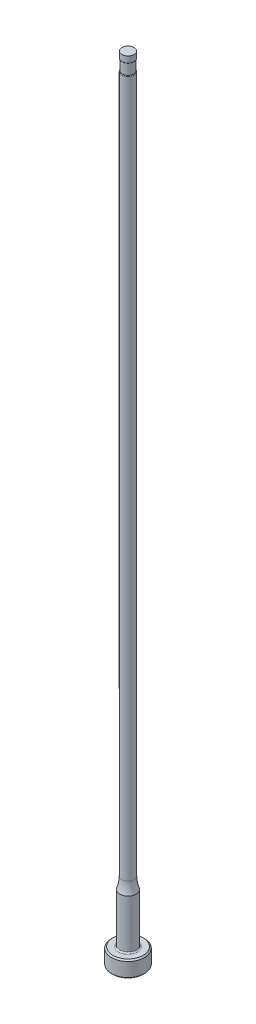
ISO-10303-21;
HEADER;
FILE_DESCRIPTION(('STEP AP214'),'2;1');
FILE_NAME('part.step','',(''),(''),'','','');
FILE_SCHEMA(('AUTOMOTIVE_DESIGN { 1 0 10303 214 1 1 1 1 }'));
ENDSEC;
DATA;
#1=APPLICATION_CONTEXT('core data for automotive mechanical design processes');
#2=APPLICATION_PROTOCOL_DEFINITION('international standard','automotive_design',2000,#1);
#3=PRODUCT_CONTEXT('',#1,'mechanical');
#4=PRODUCT('Part','Part','',(#3));
#5=PRODUCT_RELATED_PRODUCT_CATEGORY('part','',(#4));
#6=PRODUCT_DEFINITION_FORMATION('','',#4);
#7=PRODUCT_DEFINITION_CONTEXT('part definition',#1,'design');
#8=PRODUCT_DEFINITION('design','',#6,#7);
#9=PRODUCT_DEFINITION_SHAPE('','',#8);
#10=(LENGTH_UNIT() NAMED_UNIT(*) SI_UNIT(.MILLI.,.METRE.));
#11=(NAMED_UNIT(*) PLANE_ANGLE_UNIT() SI_UNIT($,.RADIAN.));
#12=(NAMED_UNIT(*) SI_UNIT($,.STERADIAN.) SOLID_ANGLE_UNIT());
#13=UNCERTAINTY_MEASURE_WITH_UNIT(LENGTH_MEASURE(1.E-05),#10,'distance_accuracy_value','');
#14=(GEOMETRIC_REPRESENTATION_CONTEXT(3) GLOBAL_UNCERTAINTY_ASSIGNED_CONTEXT((#13)) GLOBAL_UNIT_ASSIGNED_CONTEXT((#10,
#11,#12)) REPRESENTATION_CONTEXT('',''));
#15=CARTESIAN_POINT('',(0.,0.,0.));
#16=DIRECTION('',(0.,0.,1.));
#17=DIRECTION('',(1.,0.,0.));
#18=AXIS2_PLACEMENT_3D('',#15,#16,#17);
#19=CARTESIAN_POINT('',(0.,259.958771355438,0.));
#20=DIRECTION('',(0.,1.,0.));
#21=DIRECTION('',(0.,0.,1.));
#22=AXIS2_PLACEMENT_3D('',#19,#20,#21);
#23=CYLINDRICAL_SURFACE('',#22,1.18998999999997);
#24=DIRECTION('',(0.,1.,0.));
#25=VECTOR('',#24,1.);
#26=CARTESIAN_POINT('',(-1.08838999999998,259.958771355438,-0.481127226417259));
#27=LINE('',#26,#25);
#28=CARTESIAN_POINT('',(-1.08838999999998,148.973565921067,-0.481127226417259));
#29=VERTEX_POINT('',#28);
#30=CARTESIAN_POINT('',(-1.08838999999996,112.014,-0.481127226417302));
#31=VERTEX_POINT('',#30);
#32=EDGE_CURVE('E66',#29,#31,#27,.F.);
#33=ORIENTED_EDGE('',*,*,#32,.F.);
#34=CARTESIAN_POINT('',(0.,148.973565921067,0.));
#35=DIRECTION('',(0.,1.,0.));
#36=DIRECTION('',(0.,0.,1.));
#37=AXIS2_PLACEMENT_3D('',#34,#35,#36);
#38=CIRCLE('',#37,1.18998999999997);
#39=CARTESIAN_POINT('',(-1.08838999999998,148.973565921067,0.481127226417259));
#40=VERTEX_POINT('',#39);
#41=EDGE_CURVE('E44',#29,#40,#38,.F.);
#42=ORIENTED_EDGE('',*,*,#41,.T.);
#43=DIRECTION('',(0.,1.,0.));
#44=VECTOR('',#43,1.);
#45=CARTESIAN_POINT('',(-1.08838999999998,259.958771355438,0.481127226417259));
#46=LINE('',#45,#44);
#47=CARTESIAN_POINT('',(-1.08838999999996,112.014,0.481127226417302));
#48=VERTEX_POINT('',#47);
#49=EDGE_CURVE('E72',#48,#40,#46,.T.);
#50=ORIENTED_EDGE('',*,*,#49,.F.);
#51=CARTESIAN_POINT('',(-1.08838999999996,112.014,-0.481127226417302));
#52=CARTESIAN_POINT('',(-1.08838966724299,111.985183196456,-0.481120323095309));
#53=CARTESIAN_POINT('',(-1.08878297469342,111.956379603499,-0.480240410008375));
#54=CARTESIAN_POINT('',(-1.0903471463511,111.89887486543,-0.476680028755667));
#55=CARTESIAN_POINT('',(-1.09151883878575,111.870173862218,-0.473997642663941));
#56=CARTESIAN_POINT('',(-1.0962236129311,111.783732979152,-0.463079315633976));
#57=CARTESIAN_POINT('',(-1.10094613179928,111.726365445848,-0.451969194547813));
#58=CARTESIAN_POINT('',(-1.11171709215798,111.627397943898,-0.424640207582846));
#59=CARTESIAN_POINT('',(-1.11720060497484,111.585237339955,-0.41021369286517));
#60=CARTESIAN_POINT('',(-1.12939077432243,111.50375729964,-0.375363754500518));
#61=CARTESIAN_POINT('',(-1.13609165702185,111.46442562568,-0.354968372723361));
#62=CARTESIAN_POINT('',(-1.1472645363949,111.404969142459,-0.316366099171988));
#63=CARTESIAN_POINT('',(-1.15158336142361,111.383348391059,-0.300422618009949));
#64=CARTESIAN_POINT('',(-1.16012072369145,111.342602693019,-0.265553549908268));
#65=CARTESIAN_POINT('',(-1.16433935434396,111.323475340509,-0.246630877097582));
#66=CARTESIAN_POINT('',(-1.17139417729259,111.292625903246,-0.210179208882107));
#67=CARTESIAN_POINT('',(-1.17432972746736,111.280201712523,-0.193268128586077));
#68=CARTESIAN_POINT('',(-1.17964378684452,111.258180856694,-0.157607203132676));
#69=CARTESIAN_POINT('',(-1.18202305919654,111.248580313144,-0.138859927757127));
#70=CARTESIAN_POINT('',(-1.1856222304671,111.234246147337,-0.103155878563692));
#71=CARTESIAN_POINT('',(-1.1869702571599,111.228963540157,-0.0864338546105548));
#72=CARTESIAN_POINT('',(-1.18896221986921,111.221197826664,-0.05230931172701));
#73=CARTESIAN_POINT('',(-1.18960661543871,111.218712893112,-0.0349072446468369));
#74=CARTESIAN_POINT('',(-1.1901191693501,111.216734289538,0.000122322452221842));
#75=CARTESIAN_POINT('',(-1.18998545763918,111.217247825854,0.0177502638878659));
#76=CARTESIAN_POINT('',(-1.18895328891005,111.221240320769,0.0526432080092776));
#77=CARTESIAN_POINT('',(-1.18805460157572,111.224720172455,0.0699080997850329));
#78=CARTESIAN_POINT('',(-1.18562828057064,111.23423683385,0.103108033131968));
#79=CARTESIAN_POINT('',(-1.18411982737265,111.240195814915,0.11906720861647));
#80=CARTESIAN_POINT('',(-1.18061056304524,111.254296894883,0.149921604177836));
#81=CARTESIAN_POINT('',(-1.17860955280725,111.262439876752,0.164816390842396));
#82=CARTESIAN_POINT('',(-1.17313921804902,111.285184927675,0.200749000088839));
#83=CARTESIAN_POINT('',(-1.1694436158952,111.300956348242,0.221012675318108));
#84=CARTESIAN_POINT('',(-1.16168543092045,111.335494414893,0.258718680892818));
#85=CARTESIAN_POINT('',(-1.15762196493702,111.354268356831,0.276153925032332));
#86=CARTESIAN_POINT('',(-1.14734460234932,111.404227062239,0.316729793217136));
#87=CARTESIAN_POINT('',(-1.14110751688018,111.436801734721,0.338145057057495));
#88=CARTESIAN_POINT('',(-1.12927494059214,111.504924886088,0.375765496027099));
#89=CARTESIAN_POINT('',(-1.12368108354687,111.54048055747,0.391957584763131));
#90=CARTESIAN_POINT('',(-1.11078204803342,111.633330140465,0.427525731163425));
#91=CARTESIAN_POINT('',(-1.10420802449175,111.691901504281,0.443819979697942));
#92=CARTESIAN_POINT('',(-1.09432365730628,111.810957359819,0.467642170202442));
#93=CARTESIAN_POINT('',(-1.09101219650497,111.871441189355,0.475173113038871));
#94=CARTESIAN_POINT('',(-1.0890934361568,111.945778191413,0.479532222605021));
#95=CARTESIAN_POINT('',(-1.08882945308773,111.959431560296,0.480131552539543));
#96=CARTESIAN_POINT('',(-1.08847803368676,111.986722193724,0.480928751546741));
#97=CARTESIAN_POINT('',(-1.08839020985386,112.000359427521,0.481127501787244));
#98=CARTESIAN_POINT('',(-1.08838999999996,112.014,0.481127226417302));
#99=B_SPLINE_CURVE_WITH_KNOTS('',3,(#51,#52,#53,#54,#55,#56,#57,#58,#59,#60,#61,#62,#63,#64,#65,
#66,#67,#68,#69,#70,#71,#72,#73,#74,#75,#76,#77,#78,#79,#80,#81,#82,#83,#84,#85,#86,#87,#88,#89,
#90,#91,#92,#93,#94,#95,#96,#97,#98),.UNSPECIFIED.,.F.,.F.,(4,2,2,2,2,2,2,2,2,2,2,2,2,2,2,2,2,2,
2,2,2,2,2,4),(0.,0.0864065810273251,0.172905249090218,0.348016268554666,0.48234589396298,
0.616054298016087,0.697472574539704,0.778811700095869,0.842154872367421,0.905410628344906,
0.95794971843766,1.01045447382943,1.0630854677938,1.11573231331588,1.16683808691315,
1.21796455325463,1.29535063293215,1.37292769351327,1.49070506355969,1.60877526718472,
1.79125586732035,1.9736739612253,2.01467753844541,2.05559081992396),.UNSPECIFIED.);
#100=EDGE_CURVE('E74',#31,#48,#99,.T.);
#101=ORIENTED_EDGE('',*,*,#100,.F.);
#102=EDGE_LOOP('',(#33,#42,#50,#101));
#103=FACE_BOUND('',#102,.T.);
#104=CARTESIAN_POINT('',(0.,14.9114164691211,0.));
#105=DIRECTION('',(0.,1.,0.));
#106=DIRECTION('',(0.,0.,1.));
#107=AXIS2_PLACEMENT_3D('',#104,#105,#106);
#108=CIRCLE('',#107,1.18998999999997);
#109=CARTESIAN_POINT('',(0.,14.9114164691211,1.18998999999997));
#110=VERTEX_POINT('',#109);
#111=EDGE_CURVE('E95',#110,#110,#108,.T.);
#112=ORIENTED_EDGE('',*,*,#111,.T.);
#113=EDGE_LOOP('',(#112));
#114=FACE_BOUND('',#113,.T.);
#115=ADVANCED_FACE('F36',(#103,#114),#23,.T.);
#116=CARTESIAN_POINT('',(0.,14.9114164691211,0.));
#117=DIRECTION('',(0.,1.,0.));
#118=DIRECTION('',(0.,0.,1.));
#119=AXIS2_PLACEMENT_3D('',#116,#117,#118);
#120=TOROIDAL_SURFACE('',#119,7.53998999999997,6.35);
#121=CARTESIAN_POINT('',(0.,12.7,0.));
#122=DIRECTION('',(0.,1.,0.));
#123=DIRECTION('',(0.,0.,1.));
#124=AXIS2_PLACEMENT_3D('',#121,#122,#123);
#125=CIRCLE('',#124,1.58749999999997);
#126=CARTESIAN_POINT('',(0.,12.7,1.58749999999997));
#127=VERTEX_POINT('',#126);
#128=EDGE_CURVE('E92',#127,#127,#125,.T.);
#129=ORIENTED_EDGE('',*,*,#128,.T.);
#130=EDGE_LOOP('',(#129));
#131=FACE_BOUND('',#130,.T.);
#132=ORIENTED_EDGE('',*,*,#111,.F.);
#133=EDGE_LOOP('',(#132));
#134=FACE_BOUND('',#133,.T.);
#135=ADVANCED_FACE('F156',(#131,#134),#120,.F.);
#136=CARTESIAN_POINT('',(0.,259.958771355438,0.));
#137=DIRECTION('',(0.,1.,0.));
#138=DIRECTION('',(0.,0.,1.));
#139=AXIS2_PLACEMENT_3D('',#136,#137,#138);
#140=CYLINDRICAL_SURFACE('',#139,1.58749999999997);
#141=CARTESIAN_POINT('',(0.,3.42900000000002,0.));
#142=DIRECTION('',(0.,1.,0.));
#143=DIRECTION('',(0.,0.,1.));
#144=AXIS2_PLACEMENT_3D('',#141,#142,#143);
#145=CIRCLE('',#144,1.58749999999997);
#146=CARTESIAN_POINT('',(0.,3.42900000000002,1.58749999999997));
#147=VERTEX_POINT('',#146);
#148=EDGE_CURVE('E110',#147,#147,#145,.T.);
#149=ORIENTED_EDGE('',*,*,#148,.T.);
#150=EDGE_LOOP('',(#149));
#151=FACE_BOUND('',#150,.T.);
#152=ORIENTED_EDGE('',*,*,#128,.F.);
#153=EDGE_LOOP('',(#152));
#154=FACE_BOUND('',#153,.T.);
#155=ADVANCED_FACE('F153',(#151,#154),#140,.T.);
#156=CARTESIAN_POINT('',(-3.17499999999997,3.175,0.));
#157=DIRECTION('',(0.,1.,0.));
#158=DIRECTION('',(0.,0.,1.));
#159=AXIS2_PLACEMENT_3D('',#156,#157,#158);
#160=PLANE('',#159);
#161=CARTESIAN_POINT('',(0.,3.175,0.));
#162=DIRECTION('',(0.,1.,0.));
#163=DIRECTION('',(0.,0.,1.));
#164=AXIS2_PLACEMENT_3D('',#161,#162,#163);
#165=CIRCLE('',#164,1.84149999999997);
#166=CARTESIAN_POINT('',(0.,3.175,1.84149999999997));
#167=VERTEX_POINT('',#166);
#168=EDGE_CURVE('E78',#167,#167,#165,.F.);
#169=ORIENTED_EDGE('',*,*,#168,.T.);
#170=EDGE_LOOP('',(#169));
#171=FACE_BOUND('',#170,.T.);
#172=CARTESIAN_POINT('',(0.,3.175,0.));
#173=DIRECTION('',(0.,1.,0.));
#174=DIRECTION('',(0.,0.,1.));
#175=AXIS2_PLACEMENT_3D('',#172,#173,#174);
#176=CIRCLE('',#175,2.92099999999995);
#177=CARTESIAN_POINT('',(0.,3.175,2.92099999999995));
#178=VERTEX_POINT('',#177);
#179=EDGE_CURVE('E98',#178,#178,#176,.T.);
#180=ORIENTED_EDGE('',*,*,#179,.T.);
#181=EDGE_LOOP('',(#180));
#182=FACE_BOUND('',#181,.T.);
#183=ADVANCED_FACE('F149',(#171,#182),#160,.T.);
#184=CARTESIAN_POINT('',(0.,259.958771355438,0.));
#185=DIRECTION('',(0.,1.,0.));
#186=DIRECTION('',(0.,0.,1.));
#187=AXIS2_PLACEMENT_3D('',#184,#185,#186);
#188=CYLINDRICAL_SURFACE('',#187,3.17499999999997);
#189=CARTESIAN_POINT('',(0.,2.92100000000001,0.));
#190=DIRECTION('',(0.,1.,0.));
#191=DIRECTION('',(0.,0.,1.));
#192=AXIS2_PLACEMENT_3D('',#189,#190,#191);
#193=CIRCLE('',#192,3.17499999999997);
#194=CARTESIAN_POINT('',(0.,2.92100000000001,3.17499999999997));
#195=VERTEX_POINT('',#194);
#196=EDGE_CURVE('E104',#195,#195,#193,.F.);
#197=ORIENTED_EDGE('',*,*,#196,.T.);
#198=EDGE_LOOP('',(#197));
#199=FACE_BOUND('',#198,.T.);
#200=CARTESIAN_POINT('',(0.,0.254000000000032,0.));
#201=DIRECTION('',(0.,-1.,0.));
#202=DIRECTION('',(0.,0.,-1.));
#203=AXIS2_PLACEMENT_3D('',#200,#201,#202);
#204=CIRCLE('',#203,3.17499999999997);
#205=CARTESIAN_POINT('',(0.,0.254000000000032,-3.17499999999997));
#206=VERTEX_POINT('',#205);
#207=EDGE_CURVE('E101',#206,#206,#204,.F.);
#208=ORIENTED_EDGE('',*,*,#207,.T.);
#209=EDGE_LOOP('',(#208));
#210=FACE_BOUND('',#209,.T.);
#211=ADVANCED_FACE('F145',(#199,#210),#188,.T.);
#212=CARTESIAN_POINT('',(0.,0.,0.));
#213=DIRECTION('',(0.,-1.,0.));
#214=DIRECTION('',(0.,0.,-1.));
#215=AXIS2_PLACEMENT_3D('',#212,#213,#214);
#216=PLANE('',#215);
#217=CARTESIAN_POINT('',(0.,0.,0.));
#218=DIRECTION('',(0.,-1.,0.));
#219=DIRECTION('',(0.,0.,-1.));
#220=AXIS2_PLACEMENT_3D('',#217,#218,#219);
#221=CIRCLE('',#220,2.92099999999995);
#222=CARTESIAN_POINT('',(0.,0.,-2.92099999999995));
#223=VERTEX_POINT('',#222);
#224=EDGE_CURVE('E107',#223,#223,#221,.T.);
#225=ORIENTED_EDGE('',*,*,#224,.T.);
#226=EDGE_LOOP('',(#225));
#227=FACE_BOUND('',#226,.T.);
#228=ADVANCED_FACE('F141',(#227),#216,.T.);
#229=CARTESIAN_POINT('',(0.,3.17499999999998,0.));
#230=DIRECTION('',(0.,-1.,0.));
#231=DIRECTION('',(0.,0.,-1.));
#232=AXIS2_PLACEMENT_3D('',#229,#230,#231);
#233=CONICAL_SURFACE('',#232,2.92099999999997,0.7853981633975);
#234=ORIENTED_EDGE('',*,*,#196,.F.);
#235=EDGE_LOOP('',(#234));
#236=FACE_BOUND('',#235,.T.);
#237=ORIENTED_EDGE('',*,*,#179,.F.);
#238=EDGE_LOOP('',(#237));
#239=FACE_BOUND('',#238,.T.);
#240=ADVANCED_FACE('F144',(#236,#239),#233,.T.);
#241=CARTESIAN_POINT('',(0.,0.254000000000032,0.));
#242=DIRECTION('',(0.,1.,0.));
#243=DIRECTION('',(0.,0.,1.));
#244=AXIS2_PLACEMENT_3D('',#241,#242,#243);
#245=CONICAL_SURFACE('',#244,3.17499999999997,0.785398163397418);
#246=ORIENTED_EDGE('',*,*,#224,.F.);
#247=EDGE_LOOP('',(#246));
#248=FACE_BOUND('',#247,.T.);
#249=ORIENTED_EDGE('',*,*,#207,.F.);
#250=EDGE_LOOP('',(#249));
#251=FACE_BOUND('',#250,.T.);
#252=ADVANCED_FACE('F245',(#248,#251),#245,.T.);
#253=CARTESIAN_POINT('',(0.,3.42900000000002,0.));
#254=DIRECTION('',(0.,1.,0.));
#255=DIRECTION('',(0.,0.,1.));
#256=AXIS2_PLACEMENT_3D('',#253,#254,#255);
#257=TOROIDAL_SURFACE('',#256,1.84149999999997,0.254);
#258=ORIENTED_EDGE('',*,*,#168,.F.);
#259=EDGE_LOOP('',(#258));
#260=FACE_BOUND('',#259,.T.);
#261=ORIENTED_EDGE('',*,*,#148,.F.);
#262=EDGE_LOOP('',(#261));
#263=FACE_BOUND('',#262,.T.);
#264=ADVANCED_FACE('F139',(#260,#263),#257,.F.);
#265=CARTESIAN_POINT('',(0.,153.448281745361,0.));
#266=DIRECTION('',(0.,1.,0.));
#267=DIRECTION('',(0.,0.,1.));
#268=AXIS2_PLACEMENT_3D('',#265,#266,#267);
#269=CYLINDRICAL_SURFACE('',#268,1.08838999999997);
#270=CARTESIAN_POINT('',(0.,151.13,0.));
#271=DIRECTION('',(0.,1.,0.));
#272=DIRECTION('',(0.,0.,1.));
#273=AXIS2_PLACEMENT_3D('',#270,#271,#272);
#274=CIRCLE('',#273,1.08838999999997);
#275=CARTESIAN_POINT('',(0.,151.13,1.08838999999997));
#276=VERTEX_POINT('',#275);
#277=EDGE_CURVE('E71',#276,#276,#274,.T.);
#278=ORIENTED_EDGE('',*,*,#277,.F.);
#279=EDGE_LOOP('',(#278));
#280=FACE_BOUND('',#279,.T.);
#281=CARTESIAN_POINT('',(0.,149.098,0.));
#282=DIRECTION('',(0.,1.,0.));
#283=DIRECTION('',(0.,0.,1.));
#284=AXIS2_PLACEMENT_3D('',#281,#282,#283);
#285=CIRCLE('',#284,1.08838999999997);
#286=CARTESIAN_POINT('',(-1.08838999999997,149.098,0.));
#287=VERTEX_POINT('',#286);
#288=EDGE_CURVE('E89',#287,#287,#285,.T.);
#289=ORIENTED_EDGE('',*,*,#288,.T.);
#290=EDGE_LOOP('',(#289));
#291=FACE_BOUND('',#290,.T.);
#292=ADVANCED_FACE('F136',(#280,#291),#269,.T.);
#293=CARTESIAN_POINT('',(-1.08838999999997,150.114,-3.17499999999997));
#294=DIRECTION('',(1.,0.,0.));
#295=DIRECTION('',(0.,1.,0.));
#296=AXIS2_PLACEMENT_3D('',#293,#294,#295);
#297=PLANE('',#296);
#298=CARTESIAN_POINT('',(-1.08838999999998,148.973565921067,0.481127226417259));
#299=CARTESIAN_POINT('',(-1.08838999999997,148.976730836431,0.481135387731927));
#300=CARTESIAN_POINT('',(-1.08838999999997,148.979885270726,0.480835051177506));
#301=CARTESIAN_POINT('',(-1.08838999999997,148.98605903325,0.479692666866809));
#302=CARTESIAN_POINT('',(-1.08838999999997,148.989079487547,0.478856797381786));
#303=CARTESIAN_POINT('',(-1.08838999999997,148.995599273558,0.476477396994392));
#304=CARTESIAN_POINT('',(-1.08838999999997,148.999055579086,0.474817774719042));
#305=CARTESIAN_POINT('',(-1.08838999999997,149.00566384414,0.470958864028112));
#306=CARTESIAN_POINT('',(-1.08838999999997,149.008814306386,0.468757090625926));
#307=CARTESIAN_POINT('',(-1.08838999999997,149.016477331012,0.462614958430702));
#308=CARTESIAN_POINT('',(-1.08838999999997,149.020761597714,0.458392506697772));
#309=CARTESIAN_POINT('',(-1.08838999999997,149.028655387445,0.449369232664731));
#310=CARTESIAN_POINT('',(-1.08838999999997,149.032263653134,0.444567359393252));
#311=CARTESIAN_POINT('',(-1.08838999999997,149.042137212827,0.429819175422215));
#312=CARTESIAN_POINT('',(-1.08838999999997,149.047627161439,0.419360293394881));
#313=CARTESIAN_POINT('',(-1.08838999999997,149.057180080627,0.397821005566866));
#314=CARTESIAN_POINT('',(-1.08838999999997,149.061238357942,0.386738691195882));
#315=CARTESIAN_POINT('',(-1.08838999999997,149.072260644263,0.35189969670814));
#316=CARTESIAN_POINT('',(-1.08838999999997,149.077509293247,0.327613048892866));
#317=CARTESIAN_POINT('',(-1.08838999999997,149.085621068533,0.278627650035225));
#318=CARTESIAN_POINT('',(-1.08838999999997,149.088474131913,0.253927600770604));
#319=CARTESIAN_POINT('',(-1.08838999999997,149.092780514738,0.204271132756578));
#320=CARTESIAN_POINT('',(-1.08838999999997,149.09422603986,0.179314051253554));
#321=CARTESIAN_POINT('',(-1.08838999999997,149.096315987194,0.129366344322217));
#322=CARTESIAN_POINT('',(-1.08838999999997,149.096960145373,0.10437571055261));
#323=CARTESIAN_POINT('',(-1.08838999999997,149.097594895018,0.0661077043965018));
#324=CARTESIAN_POINT('',(-1.08838999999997,149.097750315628,0.0528328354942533));
#325=CARTESIAN_POINT('',(-1.08838999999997,149.097951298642,0.0263719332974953));
#326=CARTESIAN_POINT('',(-1.08838999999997,149.097997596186,0.0131859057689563));
#327=CARTESIAN_POINT('',(-1.08838999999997,149.098,0.));
#328=B_SPLINE_CURVE_WITH_KNOTS('',3,(#298,#299,#300,#301,#302,#303,#304,#305,#306,#307,#308,
#309,#310,#311,#312,#313,#314,#315,#316,#317,#318,#319,#320,#321,#322,#323,#324,#325,#326,#327),
.UNSPECIFIED.,.F.,.F.,(4,2,2,2,2,2,2,2,2,2,2,2,2,2,4),(0.,0.0094635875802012,0.0188199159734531,
0.0302585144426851,0.0417505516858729,0.0596944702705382,0.0776714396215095,0.11290930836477,
0.148261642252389,0.222508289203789,0.297065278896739,0.372032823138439,0.4470250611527,
0.486851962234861,0.526409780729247),.UNSPECIFIED.);
#329=EDGE_CURVE('E77',#40,#287,#328,.T.);
#330=ORIENTED_EDGE('',*,*,#329,.T.);
#331=CARTESIAN_POINT('',(-1.08838999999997,149.098,0.));
#332=CARTESIAN_POINT('',(-1.08838999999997,149.097979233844,-0.0211714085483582));
#333=CARTESIAN_POINT('',(-1.08838999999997,149.097872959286,-0.0423450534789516));
#334=CARTESIAN_POINT('',(-1.08838999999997,149.097341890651,-0.0847174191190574));
#335=CARTESIAN_POINT('',(-1.08838999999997,149.096916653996,-0.105916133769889));
#336=CARTESIAN_POINT('',(-1.08838999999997,149.095599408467,-0.148299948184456));
#337=CARTESIAN_POINT('',(-1.08838999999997,149.094707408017,-0.169485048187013));
#338=CARTESIAN_POINT('',(-1.08838999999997,149.092153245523,-0.211801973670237));
#339=CARTESIAN_POINT('',(-1.08838999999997,149.090491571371,-0.23293382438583));
#340=CARTESIAN_POINT('',(-1.08838999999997,149.0867838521,-0.267143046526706));
#341=CARTESIAN_POINT('',(-1.08838999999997,149.085117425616,-0.280260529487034));
#342=CARTESIAN_POINT('',(-1.08838999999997,149.081125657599,-0.306428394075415));
#343=CARTESIAN_POINT('',(-1.08838999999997,149.078798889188,-0.319478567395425));
#344=CARTESIAN_POINT('',(-1.08838999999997,149.072882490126,-0.347140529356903));
#345=CARTESIAN_POINT('',(-1.08838999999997,149.069164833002,-0.361725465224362));
#346=CARTESIAN_POINT('',(-1.08838999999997,149.060079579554,-0.390359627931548));
#347=CARTESIAN_POINT('',(-1.08838999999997,149.054719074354,-0.404410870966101));
#348=CARTESIAN_POINT('',(-1.08838999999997,149.045612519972,-0.422803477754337));
#349=CARTESIAN_POINT('',(-1.08838999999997,149.04297440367,-0.42768908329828));
#350=CARTESIAN_POINT('',(-1.08838999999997,149.037260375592,-0.437212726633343));
#351=CARTESIAN_POINT('',(-1.08838999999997,149.034183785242,-0.441850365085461));
#352=CARTESIAN_POINT('',(-1.08838999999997,149.027476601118,-0.45078486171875));
#353=CARTESIAN_POINT('',(-1.08838999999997,149.023840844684,-0.455077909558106));
#354=CARTESIAN_POINT('',(-1.08838999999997,149.015937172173,-0.463042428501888));
#355=CARTESIAN_POINT('',(-1.08838999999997,149.011671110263,-0.466715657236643));
#356=CARTESIAN_POINT('',(-1.08838999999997,149.004303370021,-0.47179758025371));
#357=CARTESIAN_POINT('',(-1.08838999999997,149.001421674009,-0.473523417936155));
#358=CARTESIAN_POINT('',(-1.08838999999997,148.995432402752,-0.476511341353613));
#359=CARTESIAN_POINT('',(-1.08838999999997,148.992325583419,-0.47777490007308));
#360=CARTESIAN_POINT('',(-1.08838999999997,148.986621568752,-0.479523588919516));
#361=CARTESIAN_POINT('',(-1.08838999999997,148.984057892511,-0.480117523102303));
#362=CARTESIAN_POINT('',(-1.08838999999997,148.978853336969,-0.480922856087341));
#363=CARTESIAN_POINT('',(-1.08838999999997,148.976212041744,-0.481131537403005));
#364=CARTESIAN_POINT('',(-1.08838999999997,148.973565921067,-0.481127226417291));
#365=B_SPLINE_CURVE_WITH_KNOTS('',3,(#331,#332,#333,#334,#335,#336,#337,#338,#339,#340,#341,
#342,#343,#344,#345,#346,#347,#348,#349,#350,#351,#352,#353,#354,#355,#356,#357,#358,#359,#360,
#361,#362,#363,#364),.UNSPECIFIED.,.F.,.F.,(4,2,2,2,2,2,2,2,2,2,2,2,2,2,2,2,4),(0.,
0.0635177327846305,0.127123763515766,0.190728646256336,0.254293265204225,0.293950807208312,
0.333694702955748,0.37880060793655,0.423714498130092,0.440354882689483,0.457021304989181,
0.473852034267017,0.490634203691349,0.500679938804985,0.510693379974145,0.518560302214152,
0.526482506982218),.UNSPECIFIED.);
#366=EDGE_CURVE('E58',#287,#29,#365,.T.);
#367=ORIENTED_EDGE('',*,*,#366,.T.);
#368=ORIENTED_EDGE('',*,*,#32,.T.);
#369=DIRECTION('',(0.,0.,1.));
#370=VECTOR('',#369,1.);
#371=CARTESIAN_POINT('',(-1.08838999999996,112.014,-3.17499999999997));
#372=LINE('',#371,#370);
#373=EDGE_CURVE('E70',#31,#48,#372,.T.);
#374=ORIENTED_EDGE('',*,*,#373,.T.);
#375=ORIENTED_EDGE('',*,*,#49,.T.);
#376=EDGE_LOOP('',(#330,#367,#368,#374,#375));
#377=FACE_BOUND('',#376,.T.);
#378=ADVANCED_FACE('F68',(#377),#297,.F.);
#379=CARTESIAN_POINT('',(-4.26338999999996,112.014,-3.17499999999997));
#380=DIRECTION('',(0.,0.,1.));
#381=DIRECTION('',(1.,0.,0.));
#382=AXIS2_PLACEMENT_3D('',#379,#380,#381);
#383=CYLINDRICAL_SURFACE('',#382,3.175);
#384=ORIENTED_EDGE('',*,*,#373,.F.);
#385=ORIENTED_EDGE('',*,*,#100,.T.);
#386=EDGE_LOOP('',(#384,#385));
#387=FACE_BOUND('',#386,.T.);
#388=ADVANCED_FACE('F80',(#387),#383,.F.);
#389=CARTESIAN_POINT('',(0.,152.687735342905,0.));
#390=DIRECTION('',(0.,1.,0.));
#391=DIRECTION('',(0.,0.,1.));
#392=AXIS2_PLACEMENT_3D('',#389,#390,#391);
#393=CYLINDRICAL_SURFACE('',#392,1.17728999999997);
#394=CARTESIAN_POINT('',(0.,151.25115027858,0.));
#395=DIRECTION('',(0.,-1.,0.));
#396=DIRECTION('',(0.,0.,-1.));
#397=AXIS2_PLACEMENT_3D('',#394,#395,#396);
#398=CIRCLE('',#397,1.17728999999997);
#399=CARTESIAN_POINT('',(0.,151.25115027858,-1.17728999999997));
#400=VERTEX_POINT('',#399);
#401=EDGE_CURVE('E11',#400,#400,#398,.F.);
#402=ORIENTED_EDGE('',*,*,#401,.T.);
#403=EDGE_LOOP('',(#402));
#404=FACE_BOUND('',#403,.T.);
#405=CARTESIAN_POINT('',(0.,152.4,0.));
#406=DIRECTION('',(0.,1.,0.));
#407=DIRECTION('',(0.,0.,1.));
#408=AXIS2_PLACEMENT_3D('',#405,#406,#407);
#409=CIRCLE('',#408,1.17728999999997);
#410=CARTESIAN_POINT('',(0.,152.4,1.17728999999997));
#411=VERTEX_POINT('',#410);
#412=EDGE_CURVE('E81',#411,#411,#409,.T.);
#413=ORIENTED_EDGE('',*,*,#412,.F.);
#414=EDGE_LOOP('',(#413));
#415=FACE_BOUND('',#414,.T.);
#416=ADVANCED_FACE('F133',(#404,#415),#393,.T.);
#417=CARTESIAN_POINT('',(-1.18998999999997,152.4,0.));
#418=DIRECTION('',(0.,1.,0.));
#419=DIRECTION('',(0.,0.,1.));
#420=AXIS2_PLACEMENT_3D('',#417,#418,#419);
#421=PLANE('',#420);
#422=ORIENTED_EDGE('',*,*,#412,.T.);
#423=EDGE_LOOP('',(#422));
#424=FACE_BOUND('',#423,.T.);
#425=ADVANCED_FACE('F177',(#424),#421,.T.);
#426=CARTESIAN_POINT('',(0.,148.973565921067,0.));
#427=DIRECTION('',(0.,1.,0.));
#428=DIRECTION('',(0.,0.,1.));
#429=AXIS2_PLACEMENT_3D('',#426,#427,#428);
#430=TOROIDAL_SURFACE('',#429,1.06298999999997,0.127);
#431=ORIENTED_EDGE('',*,*,#329,.F.);
#432=ORIENTED_EDGE('',*,*,#41,.F.);
#433=ORIENTED_EDGE('',*,*,#366,.F.);
#434=ORIENTED_EDGE('',*,*,#288,.F.);
#435=EDGE_LOOP('',(#431,#432,#433,#434));
#436=FACE_BOUND('',#435,.T.);
#437=ADVANCED_FACE('F209',(#436),#430,.T.);
#438=CARTESIAN_POINT('',(0.,151.25115027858,0.));
#439=DIRECTION('',(0.,-1.,0.));
#440=DIRECTION('',(0.,0.,-1.));
#441=AXIS2_PLACEMENT_3D('',#438,#439,#440);
#442=TOROIDAL_SURFACE('',#441,1.05028999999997,0.127);
#443=ORIENTED_EDGE('',*,*,#277,.T.);
#444=EDGE_LOOP('',(#443));
#445=FACE_BOUND('',#444,.T.);
#446=ORIENTED_EDGE('',*,*,#401,.F.);
#447=EDGE_LOOP('',(#446));
#448=FACE_BOUND('',#447,.T.);
#449=ADVANCED_FACE('F38',(#445,#448),#442,.T.);
#450=CLOSED_SHELL('',(#115,#135,#155,#183,#211,#228,#240,#252,#264,#292,#378,#388,#416,#425,
#437,#449));
#451=MANIFOLD_SOLID_BREP('B2',#450);
#452=ADVANCED_BREP_SHAPE_REPRESENTATION('',(#18,#451),#14);
#453=SHAPE_DEFINITION_REPRESENTATION(#9,#452);
ENDSEC;
END-ISO-10303-21;
